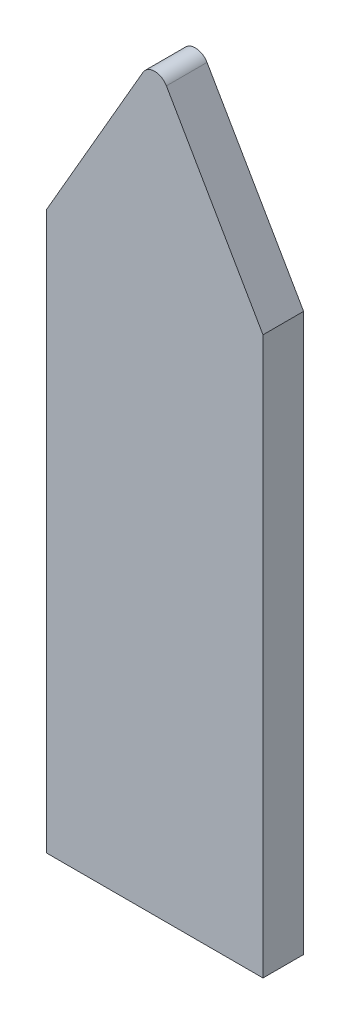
ISO-10303-21;
HEADER;
FILE_DESCRIPTION(('STEP AP214'),'2;1');
FILE_NAME('part.step','',(''),(''),'','','');
FILE_SCHEMA(('AUTOMOTIVE_DESIGN { 1 0 10303 214 1 1 1 1 }'));
ENDSEC;
DATA;
#1=APPLICATION_CONTEXT('core data for automotive mechanical design processes');
#2=APPLICATION_PROTOCOL_DEFINITION('international standard','automotive_design',2000,#1);
#3=PRODUCT_CONTEXT('',#1,'mechanical');
#4=PRODUCT('Part','Part','',(#3));
#5=PRODUCT_RELATED_PRODUCT_CATEGORY('part','',(#4));
#6=PRODUCT_DEFINITION_FORMATION('','',#4);
#7=PRODUCT_DEFINITION_CONTEXT('part definition',#1,'design');
#8=PRODUCT_DEFINITION('design','',#6,#7);
#9=PRODUCT_DEFINITION_SHAPE('','',#8);
#10=(LENGTH_UNIT() NAMED_UNIT(*) SI_UNIT(.MILLI.,.METRE.));
#11=(NAMED_UNIT(*) PLANE_ANGLE_UNIT() SI_UNIT($,.RADIAN.));
#12=(NAMED_UNIT(*) SI_UNIT($,.STERADIAN.) SOLID_ANGLE_UNIT());
#13=UNCERTAINTY_MEASURE_WITH_UNIT(LENGTH_MEASURE(1.E-05),#10,'distance_accuracy_value','');
#14=(GEOMETRIC_REPRESENTATION_CONTEXT(3) GLOBAL_UNCERTAINTY_ASSIGNED_CONTEXT((#13)) GLOBAL_UNIT_ASSIGNED_CONTEXT((#10,
#11,#12)) REPRESENTATION_CONTEXT('',''));
#15=CARTESIAN_POINT('',(0.,0.,0.));
#16=DIRECTION('',(0.,0.,1.));
#17=DIRECTION('',(1.,0.,0.));
#18=AXIS2_PLACEMENT_3D('',#15,#16,#17);
#19=CARTESIAN_POINT('',(-8.,381.143593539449,19.5));
#20=DIRECTION('',(1.,0.,0.));
#21=DIRECTION('',(0.,1.,0.));
#22=AXIS2_PLACEMENT_3D('',#19,#20,#21);
#23=PLANE('',#22);
#24=DIRECTION('',(0.,-1.,0.));
#25=VECTOR('',#24,1.);
#26=CARTESIAN_POINT('',(-8.,381.143593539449,16.5));
#27=LINE('',#26,#25);
#28=CARTESIAN_POINT('',(-8.,381.143593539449,16.5));
#29=VERTEX_POINT('',#28);
#30=CARTESIAN_POINT('',(-8.,340.,16.5));
#31=VERTEX_POINT('',#30);
#32=EDGE_CURVE('E119',#29,#31,#27,.T.);
#33=ORIENTED_EDGE('',*,*,#32,.T.);
#34=DIRECTION('',(0.,0.,-1.));
#35=VECTOR('',#34,1.);
#36=CARTESIAN_POINT('',(-8.,340.,19.5));
#37=LINE('',#36,#35);
#38=CARTESIAN_POINT('',(-8.,340.,19.5));
#39=VERTEX_POINT('',#38);
#40=EDGE_CURVE('E11',#39,#31,#37,.T.);
#41=ORIENTED_EDGE('',*,*,#40,.F.);
#42=DIRECTION('',(0.,-1.,0.));
#43=VECTOR('',#42,1.);
#44=CARTESIAN_POINT('',(-8.,381.143593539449,19.5));
#45=LINE('',#44,#43);
#46=CARTESIAN_POINT('',(-8.,381.143593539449,19.5));
#47=VERTEX_POINT('',#46);
#48=EDGE_CURVE('E129',#47,#39,#45,.T.);
#49=ORIENTED_EDGE('',*,*,#48,.F.);
#50=DIRECTION('',(0.,0.,-1.));
#51=VECTOR('',#50,1.);
#52=CARTESIAN_POINT('',(-8.,381.143593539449,19.5));
#53=LINE('',#52,#51);
#54=EDGE_CURVE('E115',#47,#29,#53,.T.);
#55=ORIENTED_EDGE('',*,*,#54,.T.);
#56=EDGE_LOOP('',(#33,#41,#49,#55));
#57=FACE_BOUND('',#56,.T.);
#58=ADVANCED_FACE('F35',(#57),#23,.F.);
#59=CARTESIAN_POINT('',(8.,340.,19.5));
#60=DIRECTION('',(0.,1.,0.));
#61=DIRECTION('',(0.,0.,1.));
#62=AXIS2_PLACEMENT_3D('',#59,#60,#61);
#63=PLANE('',#62);
#64=DIRECTION('',(1.,0.,0.));
#65=VECTOR('',#64,1.);
#66=CARTESIAN_POINT('',(8.,340.,16.5));
#67=LINE('',#66,#65);
#68=CARTESIAN_POINT('',(8.,340.,16.5));
#69=VERTEX_POINT('',#68);
#70=EDGE_CURVE('E122',#31,#69,#67,.T.);
#71=ORIENTED_EDGE('',*,*,#70,.T.);
#72=DIRECTION('',(0.,0.,-1.));
#73=VECTOR('',#72,1.);
#74=CARTESIAN_POINT('',(8.,340.,19.5));
#75=LINE('',#74,#73);
#76=CARTESIAN_POINT('',(8.,340.,19.5));
#77=VERTEX_POINT('',#76);
#78=EDGE_CURVE('E43',#77,#69,#75,.T.);
#79=ORIENTED_EDGE('',*,*,#78,.F.);
#80=DIRECTION('',(1.,0.,0.));
#81=VECTOR('',#80,1.);
#82=CARTESIAN_POINT('',(8.,340.,19.5));
#83=LINE('',#82,#81);
#84=EDGE_CURVE('E88',#39,#77,#83,.T.);
#85=ORIENTED_EDGE('',*,*,#84,.F.);
#86=ORIENTED_EDGE('',*,*,#40,.T.);
#87=EDGE_LOOP('',(#71,#79,#85,#86));
#88=FACE_BOUND('',#87,.T.);
#89=ADVANCED_FACE('F153',(#88),#63,.F.);
#90=CARTESIAN_POINT('',(8.,381.143593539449,19.5));
#91=DIRECTION('',(-1.,0.,0.));
#92=DIRECTION('',(0.,-1.,0.));
#93=AXIS2_PLACEMENT_3D('',#90,#91,#92);
#94=PLANE('',#93);
#95=DIRECTION('',(0.,1.,0.));
#96=VECTOR('',#95,1.);
#97=CARTESIAN_POINT('',(8.,381.143593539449,16.5));
#98=LINE('',#97,#96);
#99=CARTESIAN_POINT('',(8.,381.143593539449,16.5));
#100=VERTEX_POINT('',#99);
#101=EDGE_CURVE('E124',#69,#100,#98,.T.);
#102=ORIENTED_EDGE('',*,*,#101,.T.);
#103=DIRECTION('',(0.,0.,-1.));
#104=VECTOR('',#103,1.);
#105=CARTESIAN_POINT('',(8.,381.143593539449,19.5));
#106=LINE('',#105,#104);
#107=CARTESIAN_POINT('',(8.,381.143593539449,19.5));
#108=VERTEX_POINT('',#107);
#109=EDGE_CURVE('E110',#108,#100,#106,.T.);
#110=ORIENTED_EDGE('',*,*,#109,.F.);
#111=DIRECTION('',(0.,1.,0.));
#112=VECTOR('',#111,1.);
#113=CARTESIAN_POINT('',(8.,381.143593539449,19.5));
#114=LINE('',#113,#112);
#115=EDGE_CURVE('E101',#77,#108,#114,.T.);
#116=ORIENTED_EDGE('',*,*,#115,.F.);
#117=ORIENTED_EDGE('',*,*,#78,.T.);
#118=EDGE_LOOP('',(#102,#110,#116,#117));
#119=FACE_BOUND('',#118,.T.);
#120=ADVANCED_FACE('F135',(#119),#94,.F.);
#121=CARTESIAN_POINT('',(0.866025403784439,393.5,19.5));
#122=DIRECTION('',(-0.866025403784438,-0.500000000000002,0.));
#123=DIRECTION('',(0.500000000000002,-0.866025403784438,0.));
#124=AXIS2_PLACEMENT_3D('',#121,#122,#123);
#125=PLANE('',#124);
#126=DIRECTION('',(-0.500000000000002,0.866025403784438,0.));
#127=VECTOR('',#126,1.);
#128=CARTESIAN_POINT('',(0.866025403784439,393.5,16.5));
#129=LINE('',#128,#127);
#130=CARTESIAN_POINT('',(0.866025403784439,393.5,16.5));
#131=VERTEX_POINT('',#130);
#132=EDGE_CURVE('E109',#100,#131,#129,.T.);
#133=ORIENTED_EDGE('',*,*,#132,.T.);
#134=DIRECTION('',(0.,0.,-1.));
#135=VECTOR('',#134,1.);
#136=CARTESIAN_POINT('',(0.866025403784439,393.5,19.5));
#137=LINE('',#136,#135);
#138=CARTESIAN_POINT('',(0.866025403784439,393.5,19.5));
#139=VERTEX_POINT('',#138);
#140=EDGE_CURVE('E106',#139,#131,#137,.T.);
#141=ORIENTED_EDGE('',*,*,#140,.F.);
#142=DIRECTION('',(-0.500000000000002,0.866025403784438,0.));
#143=VECTOR('',#142,1.);
#144=CARTESIAN_POINT('',(0.866025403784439,393.5,19.5));
#145=LINE('',#144,#143);
#146=EDGE_CURVE('E95',#108,#139,#145,.T.);
#147=ORIENTED_EDGE('',*,*,#146,.F.);
#148=ORIENTED_EDGE('',*,*,#109,.T.);
#149=EDGE_LOOP('',(#133,#141,#147,#148));
#150=FACE_BOUND('',#149,.T.);
#151=ADVANCED_FACE('F107',(#150),#125,.F.);
#152=CARTESIAN_POINT('',(0.,393.,19.5));
#153=DIRECTION('',(0.,0.,-1.));
#154=DIRECTION('',(-1.,0.,0.));
#155=AXIS2_PLACEMENT_3D('',#152,#153,#154);
#156=CYLINDRICAL_SURFACE('',#155,1.);
#157=CARTESIAN_POINT('',(0.,393.,16.5));
#158=DIRECTION('',(0.,0.,1.));
#159=DIRECTION('',(-1.,0.,0.));
#160=AXIS2_PLACEMENT_3D('',#157,#158,#159);
#161=CIRCLE('',#160,1.);
#162=CARTESIAN_POINT('',(-0.866025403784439,393.5,16.5));
#163=VERTEX_POINT('',#162);
#164=EDGE_CURVE('E74',#131,#163,#161,.T.);
#165=ORIENTED_EDGE('',*,*,#164,.T.);
#166=DIRECTION('',(0.,0.,-1.));
#167=VECTOR('',#166,1.);
#168=CARTESIAN_POINT('',(-0.866025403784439,393.5,19.5));
#169=LINE('',#168,#167);
#170=CARTESIAN_POINT('',(-0.866025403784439,393.5,19.5));
#171=VERTEX_POINT('',#170);
#172=EDGE_CURVE('E111',#171,#163,#169,.T.);
#173=ORIENTED_EDGE('',*,*,#172,.F.);
#174=CARTESIAN_POINT('',(0.,393.,19.5));
#175=DIRECTION('',(0.,0.,1.));
#176=DIRECTION('',(-1.,0.,0.));
#177=AXIS2_PLACEMENT_3D('',#174,#175,#176);
#178=CIRCLE('',#177,1.);
#179=EDGE_CURVE('E99',#139,#171,#178,.T.);
#180=ORIENTED_EDGE('',*,*,#179,.F.);
#181=ORIENTED_EDGE('',*,*,#140,.T.);
#182=EDGE_LOOP('',(#165,#173,#180,#181));
#183=FACE_BOUND('',#182,.T.);
#184=ADVANCED_FACE('F113',(#183),#156,.T.);
#185=CARTESIAN_POINT('',(-0.866025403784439,393.5,19.5));
#186=DIRECTION('',(0.866025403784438,-0.500000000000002,0.));
#187=DIRECTION('',(0.500000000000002,0.866025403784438,0.));
#188=AXIS2_PLACEMENT_3D('',#185,#186,#187);
#189=PLANE('',#188);
#190=DIRECTION('',(-0.500000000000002,-0.866025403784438,0.));
#191=VECTOR('',#190,1.);
#192=CARTESIAN_POINT('',(-0.866025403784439,393.5,16.5));
#193=LINE('',#192,#191);
#194=EDGE_CURVE('E80',#163,#29,#193,.T.);
#195=ORIENTED_EDGE('',*,*,#194,.T.);
#196=ORIENTED_EDGE('',*,*,#54,.F.);
#197=DIRECTION('',(-0.500000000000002,-0.866025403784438,0.));
#198=VECTOR('',#197,1.);
#199=CARTESIAN_POINT('',(-0.866025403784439,393.5,19.5));
#200=LINE('',#199,#198);
#201=EDGE_CURVE('E51',#171,#47,#200,.T.);
#202=ORIENTED_EDGE('',*,*,#201,.F.);
#203=ORIENTED_EDGE('',*,*,#172,.T.);
#204=EDGE_LOOP('',(#195,#196,#202,#203));
#205=FACE_BOUND('',#204,.T.);
#206=ADVANCED_FACE('F142',(#205),#189,.F.);
#207=CARTESIAN_POINT('',(0.,393.,19.5));
#208=DIRECTION('',(0.,0.,-1.));
#209=DIRECTION('',(-1.,0.,0.));
#210=AXIS2_PLACEMENT_3D('',#207,#208,#209);
#211=PLANE('',#210);
#212=ORIENTED_EDGE('',*,*,#48,.T.);
#213=ORIENTED_EDGE('',*,*,#84,.T.);
#214=ORIENTED_EDGE('',*,*,#115,.T.);
#215=ORIENTED_EDGE('',*,*,#146,.T.);
#216=ORIENTED_EDGE('',*,*,#179,.T.);
#217=ORIENTED_EDGE('',*,*,#201,.T.);
#218=EDGE_LOOP('',(#212,#213,#214,#215,#216,#217));
#219=FACE_BOUND('',#218,.T.);
#220=ADVANCED_FACE('F97',(#219),#211,.F.);
#221=CARTESIAN_POINT('',(0.,393.,16.5));
#222=DIRECTION('',(0.,0.,-1.));
#223=DIRECTION('',(-1.,0.,0.));
#224=AXIS2_PLACEMENT_3D('',#221,#222,#223);
#225=PLANE('',#224);
#226=ORIENTED_EDGE('',*,*,#32,.F.);
#227=ORIENTED_EDGE('',*,*,#194,.F.);
#228=ORIENTED_EDGE('',*,*,#164,.F.);
#229=ORIENTED_EDGE('',*,*,#132,.F.);
#230=ORIENTED_EDGE('',*,*,#101,.F.);
#231=ORIENTED_EDGE('',*,*,#70,.F.);
#232=EDGE_LOOP('',(#226,#227,#228,#229,#230,#231));
#233=FACE_BOUND('',#232,.T.);
#234=ADVANCED_FACE('F138',(#233),#225,.T.);
#235=CLOSED_SHELL('',(#58,#89,#120,#151,#184,#206,#220,#234));
#236=MANIFOLD_SOLID_BREP('B2',#235);
#237=ADVANCED_BREP_SHAPE_REPRESENTATION('',(#18,#236),#14);
#238=SHAPE_DEFINITION_REPRESENTATION(#9,#237);
ENDSEC;
END-ISO-10303-21;
